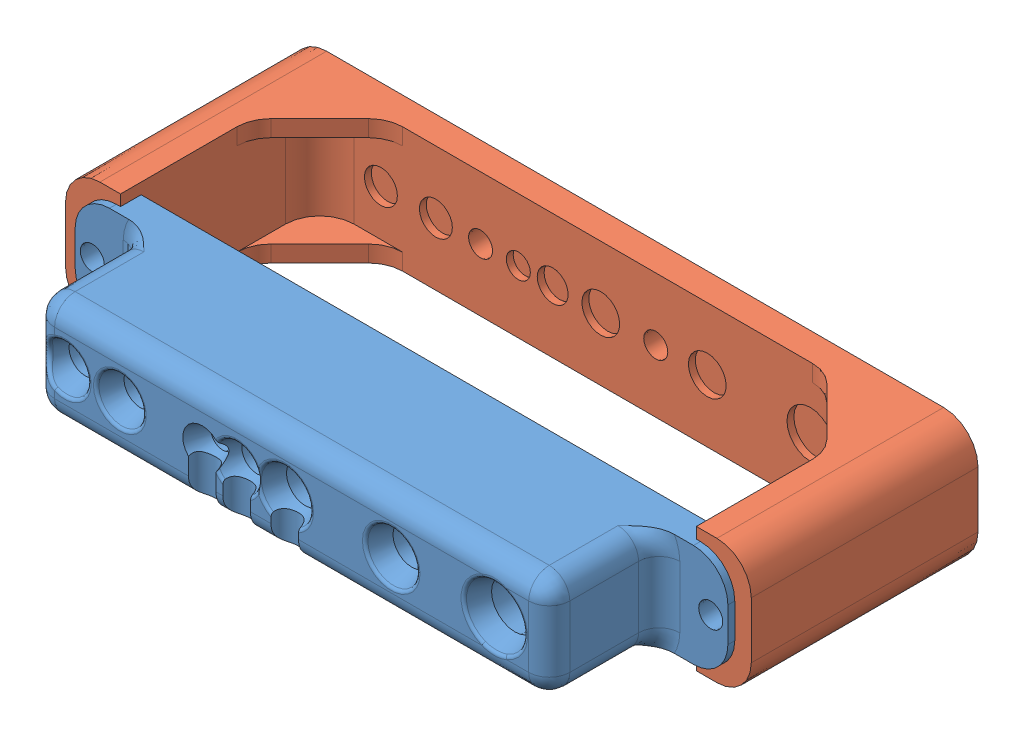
SolidWorks assembly Complete holder.SLDASM, configuration Default (file format 7000). Lengths in mm.
Overall size (99.8 18.2 50.23).
2 component instances, 2 part files, 0 mates.
Components (placement in the parent):
- Sherline tool organizer-1: Sherline tool organizer.SLDPRT [Default] at origin size (95 15 20.23)
- Sherline Tools Lower holder-1: Sherline Tools Lower holder.sldprt [Default] at origin size (99.8 18.2 33)
